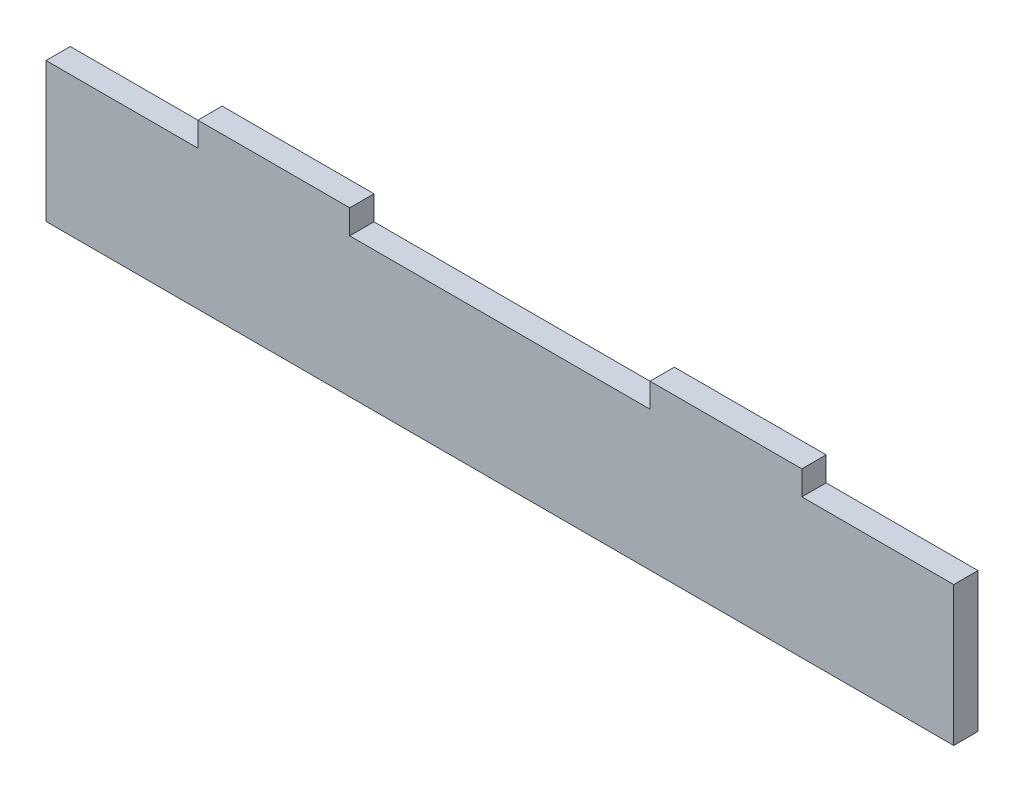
ISO-10303-21;
HEADER;
FILE_DESCRIPTION(('STEP AP214'),'2;1');
FILE_NAME('part.step','',(''),(''),'','','');
FILE_SCHEMA(('AUTOMOTIVE_DESIGN { 1 0 10303 214 1 1 1 1 }'));
ENDSEC;
DATA;
#1=APPLICATION_CONTEXT('core data for automotive mechanical design processes');
#2=APPLICATION_PROTOCOL_DEFINITION('international standard','automotive_design',2000,#1);
#3=PRODUCT_CONTEXT('',#1,'mechanical');
#4=PRODUCT('Part','Part','',(#3));
#5=PRODUCT_RELATED_PRODUCT_CATEGORY('part','',(#4));
#6=PRODUCT_DEFINITION_FORMATION('','',#4);
#7=PRODUCT_DEFINITION_CONTEXT('part definition',#1,'design');
#8=PRODUCT_DEFINITION('design','',#6,#7);
#9=PRODUCT_DEFINITION_SHAPE('','',#8);
#10=(LENGTH_UNIT() NAMED_UNIT(*) SI_UNIT(.MILLI.,.METRE.));
#11=(NAMED_UNIT(*) PLANE_ANGLE_UNIT() SI_UNIT($,.RADIAN.));
#12=(NAMED_UNIT(*) SI_UNIT($,.STERADIAN.) SOLID_ANGLE_UNIT());
#13=UNCERTAINTY_MEASURE_WITH_UNIT(LENGTH_MEASURE(1.E-05),#10,'distance_accuracy_value','');
#14=(GEOMETRIC_REPRESENTATION_CONTEXT(3) GLOBAL_UNCERTAINTY_ASSIGNED_CONTEXT((#13)) GLOBAL_UNIT_ASSIGNED_CONTEXT((#10,
#11,#12)) REPRESENTATION_CONTEXT('',''));
#15=CARTESIAN_POINT('',(0.,0.,0.));
#16=DIRECTION('',(0.,0.,1.));
#17=DIRECTION('',(1.,0.,0.));
#18=AXIS2_PLACEMENT_3D('',#15,#16,#17);
#19=CARTESIAN_POINT('',(0.,0.,16.));
#20=DIRECTION('',(0.,1.,0.));
#21=DIRECTION('',(0.,0.,1.));
#22=AXIS2_PLACEMENT_3D('',#19,#20,#21);
#23=PLANE('',#22);
#24=DIRECTION('',(1.,0.,0.));
#25=VECTOR('',#24,1.);
#26=CARTESIAN_POINT('',(0.,0.,0.));
#27=LINE('',#26,#25);
#28=CARTESIAN_POINT('',(0.,0.,0.));
#29=VERTEX_POINT('',#28);
#30=CARTESIAN_POINT('',(597.8,0.,0.));
#31=VERTEX_POINT('',#30);
#32=EDGE_CURVE('E134',#29,#31,#27,.T.);
#33=ORIENTED_EDGE('',*,*,#32,.T.);
#34=DIRECTION('',(0.,0.,-1.));
#35=VECTOR('',#34,1.);
#36=CARTESIAN_POINT('',(597.8,0.,16.));
#37=LINE('',#36,#35);
#38=CARTESIAN_POINT('',(597.8,0.,16.));
#39=VERTEX_POINT('',#38);
#40=EDGE_CURVE('E122',#39,#31,#37,.T.);
#41=ORIENTED_EDGE('',*,*,#40,.F.);
#42=DIRECTION('',(1.,0.,0.));
#43=VECTOR('',#42,1.);
#44=CARTESIAN_POINT('',(0.,0.,16.));
#45=LINE('',#44,#43);
#46=CARTESIAN_POINT('',(0.,0.,16.));
#47=VERTEX_POINT('',#46);
#48=EDGE_CURVE('E142',#47,#39,#45,.T.);
#49=ORIENTED_EDGE('',*,*,#48,.F.);
#50=DIRECTION('',(0.,0.,-1.));
#51=VECTOR('',#50,1.);
#52=CARTESIAN_POINT('',(0.,0.,16.));
#53=LINE('',#52,#51);
#54=EDGE_CURVE('E118',#47,#29,#53,.T.);
#55=ORIENTED_EDGE('',*,*,#54,.T.);
#56=EDGE_LOOP('',(#33,#41,#49,#55));
#57=FACE_BOUND('',#56,.T.);
#58=ADVANCED_FACE('F33',(#57),#23,.F.);
#59=CARTESIAN_POINT('',(0.,0.,16.));
#60=DIRECTION('',(-1.,0.,0.));
#61=DIRECTION('',(0.,0.,1.));
#62=AXIS2_PLACEMENT_3D('',#59,#60,#61);
#63=PLANE('',#62);
#64=DIRECTION('',(0.,1.,0.));
#65=VECTOR('',#64,1.);
#66=CARTESIAN_POINT('',(0.,0.,0.));
#67=LINE('',#66,#65);
#68=CARTESIAN_POINT('',(0.,91.8,0.));
#69=VERTEX_POINT('',#68);
#70=EDGE_CURVE('E165',#29,#69,#67,.T.);
#71=ORIENTED_EDGE('',*,*,#70,.F.);
#72=ORIENTED_EDGE('',*,*,#54,.F.);
#73=DIRECTION('',(0.,1.,0.));
#74=VECTOR('',#73,1.);
#75=CARTESIAN_POINT('',(0.,0.,16.));
#76=LINE('',#75,#74);
#77=CARTESIAN_POINT('',(0.,91.8,16.));
#78=VERTEX_POINT('',#77);
#79=EDGE_CURVE('E187',#47,#78,#76,.T.);
#80=ORIENTED_EDGE('',*,*,#79,.T.);
#81=DIRECTION('',(0.,0.,-1.));
#82=VECTOR('',#81,1.);
#83=CARTESIAN_POINT('',(0.,91.8,16.));
#84=LINE('',#83,#82);
#85=EDGE_CURVE('E139',#78,#69,#84,.T.);
#86=ORIENTED_EDGE('',*,*,#85,.T.);
#87=EDGE_LOOP('',(#71,#72,#80,#86));
#88=FACE_BOUND('',#87,.T.);
#89=ADVANCED_FACE('F246',(#88),#63,.T.);
#90=CARTESIAN_POINT('',(597.8,0.,16.));
#91=DIRECTION('',(-1.,0.,0.));
#92=DIRECTION('',(0.,0.,1.));
#93=AXIS2_PLACEMENT_3D('',#90,#91,#92);
#94=PLANE('',#93);
#95=DIRECTION('',(0.,1.,0.));
#96=VECTOR('',#95,1.);
#97=CARTESIAN_POINT('',(597.8,0.,0.));
#98=LINE('',#97,#96);
#99=CARTESIAN_POINT('',(597.8,91.8,0.));
#100=VERTEX_POINT('',#99);
#101=EDGE_CURVE('E183',#31,#100,#98,.T.);
#102=ORIENTED_EDGE('',*,*,#101,.T.);
#103=DIRECTION('',(0.,0.,-1.));
#104=VECTOR('',#103,1.);
#105=CARTESIAN_POINT('',(597.8,91.8,16.));
#106=LINE('',#105,#104);
#107=CARTESIAN_POINT('',(597.8,91.8,16.));
#108=VERTEX_POINT('',#107);
#109=EDGE_CURVE('E131',#108,#100,#106,.T.);
#110=ORIENTED_EDGE('',*,*,#109,.F.);
#111=DIRECTION('',(0.,1.,0.));
#112=VECTOR('',#111,1.);
#113=CARTESIAN_POINT('',(597.8,0.,16.));
#114=LINE('',#113,#112);
#115=EDGE_CURVE('E201',#39,#108,#114,.T.);
#116=ORIENTED_EDGE('',*,*,#115,.F.);
#117=ORIENTED_EDGE('',*,*,#40,.T.);
#118=EDGE_LOOP('',(#102,#110,#116,#117));
#119=FACE_BOUND('',#118,.T.);
#120=ADVANCED_FACE('F214',(#119),#94,.F.);
#121=CARTESIAN_POINT('',(0.,0.,0.));
#122=DIRECTION('',(0.,0.,-1.));
#123=DIRECTION('',(-1.,0.,0.));
#124=AXIS2_PLACEMENT_3D('',#121,#122,#123);
#125=PLANE('',#124);
#126=ORIENTED_EDGE('',*,*,#70,.T.);
#127=DIRECTION('',(1.,0.,0.));
#128=VECTOR('',#127,1.);
#129=CARTESIAN_POINT('',(0.,91.8,0.));
#130=LINE('',#129,#128);
#131=CARTESIAN_POINT('',(100.,91.8,0.));
#132=VERTEX_POINT('',#131);
#133=EDGE_CURVE('E180',#69,#132,#130,.T.);
#134=ORIENTED_EDGE('',*,*,#133,.T.);
#135=DIRECTION('',(0.,1.,0.));
#136=VECTOR('',#135,1.);
#137=CARTESIAN_POINT('',(100.,91.8,0.));
#138=LINE('',#137,#136);
#139=CARTESIAN_POINT('',(100.,107.8,0.));
#140=VERTEX_POINT('',#139);
#141=EDGE_CURVE('E153',#132,#140,#138,.T.);
#142=ORIENTED_EDGE('',*,*,#141,.T.);
#143=DIRECTION('',(1.,0.,0.));
#144=VECTOR('',#143,1.);
#145=CARTESIAN_POINT('',(100.,107.8,0.));
#146=LINE('',#145,#144);
#147=CARTESIAN_POINT('',(200.,107.8,0.));
#148=VERTEX_POINT('',#147);
#149=EDGE_CURVE('E156',#140,#148,#146,.T.);
#150=ORIENTED_EDGE('',*,*,#149,.T.);
#151=DIRECTION('',(0.,1.,0.));
#152=VECTOR('',#151,1.);
#153=CARTESIAN_POINT('',(200.,91.8,0.));
#154=LINE('',#153,#152);
#155=CARTESIAN_POINT('',(200.,91.8,0.));
#156=VERTEX_POINT('',#155);
#157=EDGE_CURVE('E147',#156,#148,#154,.T.);
#158=ORIENTED_EDGE('',*,*,#157,.F.);
#159=CARTESIAN_POINT('',(397.8,91.8,0.));
#160=VERTEX_POINT('',#159);
#161=EDGE_CURVE('E107',#156,#160,#130,.T.);
#162=ORIENTED_EDGE('',*,*,#161,.T.);
#163=DIRECTION('',(0.,1.,0.));
#164=VECTOR('',#163,1.);
#165=CARTESIAN_POINT('',(397.8,91.8,0.));
#166=LINE('',#165,#164);
#167=CARTESIAN_POINT('',(397.8,107.8,0.));
#168=VERTEX_POINT('',#167);
#169=EDGE_CURVE('E93',#160,#168,#166,.T.);
#170=ORIENTED_EDGE('',*,*,#169,.T.);
#171=DIRECTION('',(-1.,0.,0.));
#172=VECTOR('',#171,1.);
#173=CARTESIAN_POINT('',(497.8,107.8,0.));
#174=LINE('',#173,#172);
#175=CARTESIAN_POINT('',(497.8,107.8,0.));
#176=VERTEX_POINT('',#175);
#177=EDGE_CURVE('E83',#176,#168,#174,.T.);
#178=ORIENTED_EDGE('',*,*,#177,.F.);
#179=DIRECTION('',(0.,1.,0.));
#180=VECTOR('',#179,1.);
#181=CARTESIAN_POINT('',(497.8,91.8,0.));
#182=LINE('',#181,#180);
#183=CARTESIAN_POINT('',(497.8,91.8,0.));
#184=VERTEX_POINT('',#183);
#185=EDGE_CURVE('E101',#184,#176,#182,.T.);
#186=ORIENTED_EDGE('',*,*,#185,.F.);
#187=EDGE_CURVE('E173',#184,#100,#130,.T.);
#188=ORIENTED_EDGE('',*,*,#187,.T.);
#189=ORIENTED_EDGE('',*,*,#101,.F.);
#190=ORIENTED_EDGE('',*,*,#32,.F.);
#191=EDGE_LOOP('',(#126,#134,#142,#150,#158,#162,#170,#178,#186,#188,#189,#190));
#192=FACE_BOUND('',#191,.T.);
#193=ADVANCED_FACE('F104',(#192),#125,.T.);
#194=CARTESIAN_POINT('',(0.,0.,16.));
#195=DIRECTION('',(0.,0.,-1.));
#196=DIRECTION('',(-1.,0.,0.));
#197=AXIS2_PLACEMENT_3D('',#194,#195,#196);
#198=PLANE('',#197);
#199=ORIENTED_EDGE('',*,*,#79,.F.);
#200=ORIENTED_EDGE('',*,*,#48,.T.);
#201=ORIENTED_EDGE('',*,*,#115,.T.);
#202=DIRECTION('',(1.,0.,0.));
#203=VECTOR('',#202,1.);
#204=CARTESIAN_POINT('',(0.,91.8,16.));
#205=LINE('',#204,#203);
#206=CARTESIAN_POINT('',(497.8,91.8,16.));
#207=VERTEX_POINT('',#206);
#208=EDGE_CURVE('E191',#207,#108,#205,.T.);
#209=ORIENTED_EDGE('',*,*,#208,.F.);
#210=DIRECTION('',(0.,1.,0.));
#211=VECTOR('',#210,1.);
#212=CARTESIAN_POINT('',(497.8,91.8,16.));
#213=LINE('',#212,#211);
#214=CARTESIAN_POINT('',(497.8,107.8,16.));
#215=VERTEX_POINT('',#214);
#216=EDGE_CURVE('E108',#207,#215,#213,.T.);
#217=ORIENTED_EDGE('',*,*,#216,.T.);
#218=DIRECTION('',(-1.,0.,0.));
#219=VECTOR('',#218,1.);
#220=CARTESIAN_POINT('',(497.8,107.8,16.));
#221=LINE('',#220,#219);
#222=CARTESIAN_POINT('',(397.8,107.8,16.));
#223=VERTEX_POINT('',#222);
#224=EDGE_CURVE('E111',#215,#223,#221,.T.);
#225=ORIENTED_EDGE('',*,*,#224,.T.);
#226=DIRECTION('',(0.,1.,0.));
#227=VECTOR('',#226,1.);
#228=CARTESIAN_POINT('',(397.8,91.8,16.));
#229=LINE('',#228,#227);
#230=CARTESIAN_POINT('',(397.8,91.8,16.));
#231=VERTEX_POINT('',#230);
#232=EDGE_CURVE('E96',#231,#223,#229,.T.);
#233=ORIENTED_EDGE('',*,*,#232,.F.);
#234=CARTESIAN_POINT('',(200.,91.8,16.));
#235=VERTEX_POINT('',#234);
#236=EDGE_CURVE('E196',#235,#231,#205,.T.);
#237=ORIENTED_EDGE('',*,*,#236,.F.);
#238=DIRECTION('',(0.,1.,0.));
#239=VECTOR('',#238,1.);
#240=CARTESIAN_POINT('',(200.,91.8,16.));
#241=LINE('',#240,#239);
#242=CARTESIAN_POINT('',(200.,107.8,16.));
#243=VERTEX_POINT('',#242);
#244=EDGE_CURVE('E150',#235,#243,#241,.T.);
#245=ORIENTED_EDGE('',*,*,#244,.T.);
#246=DIRECTION('',(1.,0.,0.));
#247=VECTOR('',#246,1.);
#248=CARTESIAN_POINT('',(100.,107.8,16.));
#249=LINE('',#248,#247);
#250=CARTESIAN_POINT('',(100.,107.8,16.));
#251=VERTEX_POINT('',#250);
#252=EDGE_CURVE('E146',#251,#243,#249,.T.);
#253=ORIENTED_EDGE('',*,*,#252,.F.);
#254=DIRECTION('',(0.,1.,0.));
#255=VECTOR('',#254,1.);
#256=CARTESIAN_POINT('',(100.,91.8,16.));
#257=LINE('',#256,#255);
#258=CARTESIAN_POINT('',(100.,91.8,16.));
#259=VERTEX_POINT('',#258);
#260=EDGE_CURVE('E143',#259,#251,#257,.T.);
#261=ORIENTED_EDGE('',*,*,#260,.F.);
#262=EDGE_CURVE('E198',#78,#259,#205,.T.);
#263=ORIENTED_EDGE('',*,*,#262,.F.);
#264=EDGE_LOOP('',(#199,#200,#201,#209,#217,#225,#233,#237,#245,#253,#261,#263));
#265=FACE_BOUND('',#264,.T.);
#266=ADVANCED_FACE('F207',(#265),#198,.F.);
#267=CARTESIAN_POINT('',(0.,91.8,16.));
#268=DIRECTION('',(0.,1.,0.));
#269=DIRECTION('',(0.,0.,1.));
#270=AXIS2_PLACEMENT_3D('',#267,#268,#269);
#271=PLANE('',#270);
#272=DIRECTION('',(0.,0.,-1.));
#273=VECTOR('',#272,1.);
#274=CARTESIAN_POINT('',(200.,91.8,16.));
#275=LINE('',#274,#273);
#276=EDGE_CURVE('E11',#235,#156,#275,.T.);
#277=ORIENTED_EDGE('',*,*,#276,.F.);
#278=ORIENTED_EDGE('',*,*,#236,.T.);
#279=DIRECTION('',(0.,0.,-1.));
#280=VECTOR('',#279,1.);
#281=CARTESIAN_POINT('',(397.8,91.8,16.));
#282=LINE('',#281,#280);
#283=EDGE_CURVE('E116',#231,#160,#282,.T.);
#284=ORIENTED_EDGE('',*,*,#283,.T.);
#285=ORIENTED_EDGE('',*,*,#161,.F.);
#286=EDGE_LOOP('',(#277,#278,#284,#285));
#287=FACE_BOUND('',#286,.T.);
#288=ADVANCED_FACE('F231',(#287),#271,.T.);
#289=DIRECTION('',(0.,0.,-1.));
#290=VECTOR('',#289,1.);
#291=CARTESIAN_POINT('',(497.8,91.8,16.));
#292=LINE('',#291,#290);
#293=EDGE_CURVE('E52',#207,#184,#292,.T.);
#294=ORIENTED_EDGE('',*,*,#293,.F.);
#295=ORIENTED_EDGE('',*,*,#208,.T.);
#296=ORIENTED_EDGE('',*,*,#109,.T.);
#297=ORIENTED_EDGE('',*,*,#187,.F.);
#298=EDGE_LOOP('',(#294,#295,#296,#297));
#299=FACE_BOUND('',#298,.T.);
#300=ADVANCED_FACE('F176',(#299),#271,.T.);
#301=ORIENTED_EDGE('',*,*,#262,.T.);
#302=DIRECTION('',(0.,0.,-1.));
#303=VECTOR('',#302,1.);
#304=CARTESIAN_POINT('',(100.,91.8,16.));
#305=LINE('',#304,#303);
#306=EDGE_CURVE('E43',#259,#132,#305,.T.);
#307=ORIENTED_EDGE('',*,*,#306,.T.);
#308=ORIENTED_EDGE('',*,*,#133,.F.);
#309=ORIENTED_EDGE('',*,*,#85,.F.);
#310=EDGE_LOOP('',(#301,#307,#308,#309));
#311=FACE_BOUND('',#310,.T.);
#312=ADVANCED_FACE('F244',(#311),#271,.T.);
#313=CARTESIAN_POINT('',(497.8,107.8,16.));
#314=DIRECTION('',(0.,-1.,0.));
#315=DIRECTION('',(0.,0.,-1.));
#316=AXIS2_PLACEMENT_3D('',#313,#314,#315);
#317=PLANE('',#316);
#318=ORIENTED_EDGE('',*,*,#177,.T.);
#319=DIRECTION('',(0.,0.,-1.));
#320=VECTOR('',#319,1.);
#321=CARTESIAN_POINT('',(397.8,107.8,16.));
#322=LINE('',#321,#320);
#323=EDGE_CURVE('E90',#223,#168,#322,.T.);
#324=ORIENTED_EDGE('',*,*,#323,.F.);
#325=ORIENTED_EDGE('',*,*,#224,.F.);
#326=DIRECTION('',(0.,0.,-1.));
#327=VECTOR('',#326,1.);
#328=CARTESIAN_POINT('',(497.8,107.8,16.));
#329=LINE('',#328,#327);
#330=EDGE_CURVE('E37',#215,#176,#329,.T.);
#331=ORIENTED_EDGE('',*,*,#330,.T.);
#332=EDGE_LOOP('',(#318,#324,#325,#331));
#333=FACE_BOUND('',#332,.T.);
#334=ADVANCED_FACE('F98',(#333),#317,.F.);
#335=CARTESIAN_POINT('',(397.8,91.8,16.));
#336=DIRECTION('',(-1.,0.,0.));
#337=DIRECTION('',(0.,0.,1.));
#338=AXIS2_PLACEMENT_3D('',#335,#336,#337);
#339=PLANE('',#338);
#340=ORIENTED_EDGE('',*,*,#169,.F.);
#341=ORIENTED_EDGE('',*,*,#283,.F.);
#342=ORIENTED_EDGE('',*,*,#232,.T.);
#343=ORIENTED_EDGE('',*,*,#323,.T.);
#344=EDGE_LOOP('',(#340,#341,#342,#343));
#345=FACE_BOUND('',#344,.T.);
#346=ADVANCED_FACE('F91',(#345),#339,.T.);
#347=CARTESIAN_POINT('',(497.8,91.8,16.));
#348=DIRECTION('',(-1.,0.,0.));
#349=DIRECTION('',(0.,0.,1.));
#350=AXIS2_PLACEMENT_3D('',#347,#348,#349);
#351=PLANE('',#350);
#352=ORIENTED_EDGE('',*,*,#185,.T.);
#353=ORIENTED_EDGE('',*,*,#330,.F.);
#354=ORIENTED_EDGE('',*,*,#216,.F.);
#355=ORIENTED_EDGE('',*,*,#293,.T.);
#356=EDGE_LOOP('',(#352,#353,#354,#355));
#357=FACE_BOUND('',#356,.T.);
#358=ADVANCED_FACE('F35',(#357),#351,.F.);
#359=CARTESIAN_POINT('',(100.,107.8,16.));
#360=DIRECTION('',(0.,1.,0.));
#361=DIRECTION('',(0.,0.,1.));
#362=AXIS2_PLACEMENT_3D('',#359,#360,#361);
#363=PLANE('',#362);
#364=ORIENTED_EDGE('',*,*,#149,.F.);
#365=DIRECTION('',(0.,0.,-1.));
#366=VECTOR('',#365,1.);
#367=CARTESIAN_POINT('',(100.,107.8,16.));
#368=LINE('',#367,#366);
#369=EDGE_CURVE('E152',#251,#140,#368,.T.);
#370=ORIENTED_EDGE('',*,*,#369,.F.);
#371=ORIENTED_EDGE('',*,*,#252,.T.);
#372=DIRECTION('',(0.,0.,-1.));
#373=VECTOR('',#372,1.);
#374=CARTESIAN_POINT('',(200.,107.8,16.));
#375=LINE('',#374,#373);
#376=EDGE_CURVE('E163',#243,#148,#375,.T.);
#377=ORIENTED_EDGE('',*,*,#376,.T.);
#378=EDGE_LOOP('',(#364,#370,#371,#377));
#379=FACE_BOUND('',#378,.T.);
#380=ADVANCED_FACE('F259',(#379),#363,.T.);
#381=CARTESIAN_POINT('',(100.,91.8,16.));
#382=DIRECTION('',(-1.,0.,0.));
#383=DIRECTION('',(0.,0.,1.));
#384=AXIS2_PLACEMENT_3D('',#381,#382,#383);
#385=PLANE('',#384);
#386=ORIENTED_EDGE('',*,*,#141,.F.);
#387=ORIENTED_EDGE('',*,*,#306,.F.);
#388=ORIENTED_EDGE('',*,*,#260,.T.);
#389=ORIENTED_EDGE('',*,*,#369,.T.);
#390=EDGE_LOOP('',(#386,#387,#388,#389));
#391=FACE_BOUND('',#390,.T.);
#392=ADVANCED_FACE('F241',(#391),#385,.T.);
#393=CARTESIAN_POINT('',(200.,91.8,16.));
#394=DIRECTION('',(-1.,0.,0.));
#395=DIRECTION('',(0.,0.,1.));
#396=AXIS2_PLACEMENT_3D('',#393,#394,#395);
#397=PLANE('',#396);
#398=ORIENTED_EDGE('',*,*,#157,.T.);
#399=ORIENTED_EDGE('',*,*,#376,.F.);
#400=ORIENTED_EDGE('',*,*,#244,.F.);
#401=ORIENTED_EDGE('',*,*,#276,.T.);
#402=EDGE_LOOP('',(#398,#399,#400,#401));
#403=FACE_BOUND('',#402,.T.);
#404=ADVANCED_FACE('F235',(#403),#397,.F.);
#405=CLOSED_SHELL('',(#58,#89,#120,#193,#266,#288,#300,#312,#334,#346,#358,#380,#392,#404));
#406=MANIFOLD_SOLID_BREP('B2',#405);
#407=ADVANCED_BREP_SHAPE_REPRESENTATION('',(#18,#406),#14);
#408=SHAPE_DEFINITION_REPRESENTATION(#9,#407);
ENDSEC;
END-ISO-10303-21;
